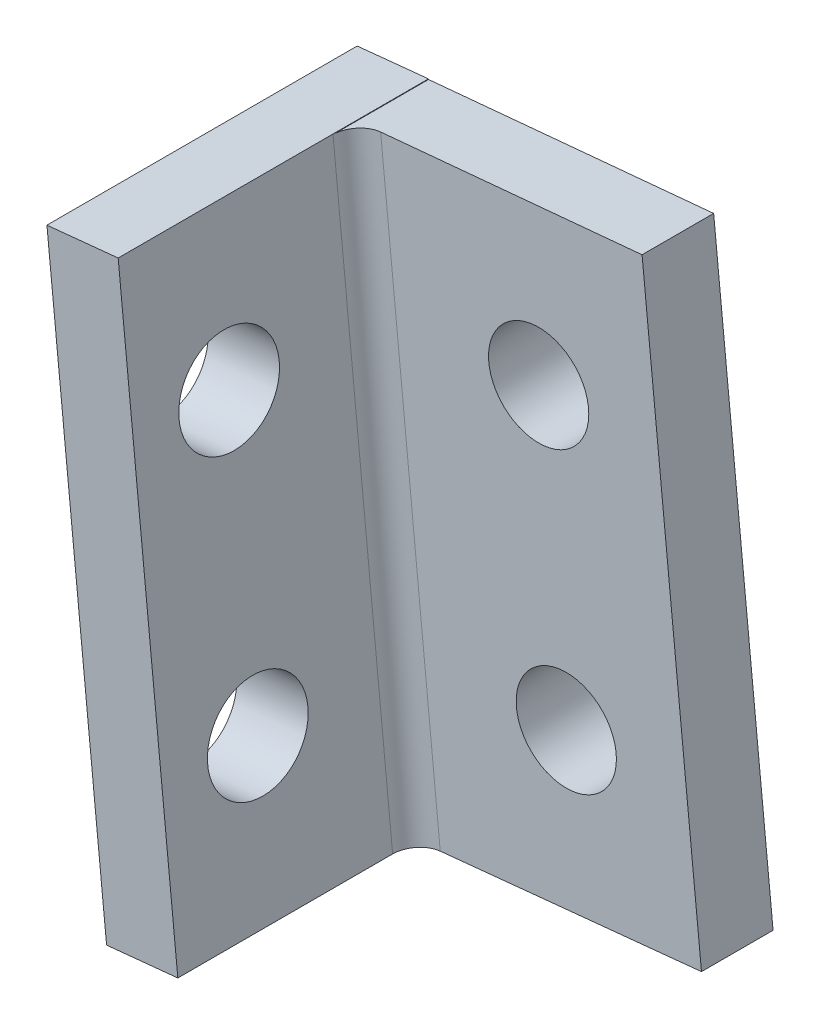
from build123d import *

# Parameters (mm, degrees)
SKETCH1_R           = 2.1
BOSS_EXTRUDE1_DEPTH = 3
SKETCH3_W           = 13
SKETCH3_H           = 25
SKETCH3_R           = 2.1
BOSS_EXTRUDE2_DEPTH = 3
FILLET1_R           = 1


with BuildPart() as part:
    # Sketch1 → Boss-Extrude1 (new body)
    with BuildSketch(Plane.XY):
        Polygon((-105, 44.736808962), (-102.5, 19.862123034), (-87.575188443, 21.362123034), (-90.064854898, 46.130164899), align=None)
        with Locations((-94.396840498, 39.233865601)):
            Circle(SKETCH1_R, mode=Mode.SUBTRACT)
        with Locations((-93.239490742, 27.289806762)):
            Circle(SKETCH1_R, mode=Mode.SUBTRACT)
    extrude(amount=BOSS_EXTRUDE1_DEPTH)

    # Sketch3 → Boss-Extrude2 (add)
    with BuildSketch(Plane(origin=(-99.498743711, -10, 0), x_dir=(0, 0, 1), z_dir=(-0.9949874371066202, -0.09999999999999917, 0))):
        with Locations((6.5, 42.512562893)):
            Rectangle(SKETCH3_W, SKETCH3_H)
        with Locations(Location((9, 36.512562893, 0), (0, 0, 270))):
            Circle(SKETCH3_R, mode=Mode.SUBTRACT)
        with Locations(Location((9, 48.512562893, 0), (0, 0, 270))):
            Circle(SKETCH3_R, mode=Mode.SUBTRACT)
    extrude(amount=-BOSS_EXTRUDE2_DEPTH)

    # Fillet1
    fillet1_edges = [part.edges().sort_by_distance(p)[0] for p in [
        (-100.763966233, 32.588805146, 3),
    ]]
    fillet(fillet1_edges, radius=FILLET1_R)


solid = part.part
